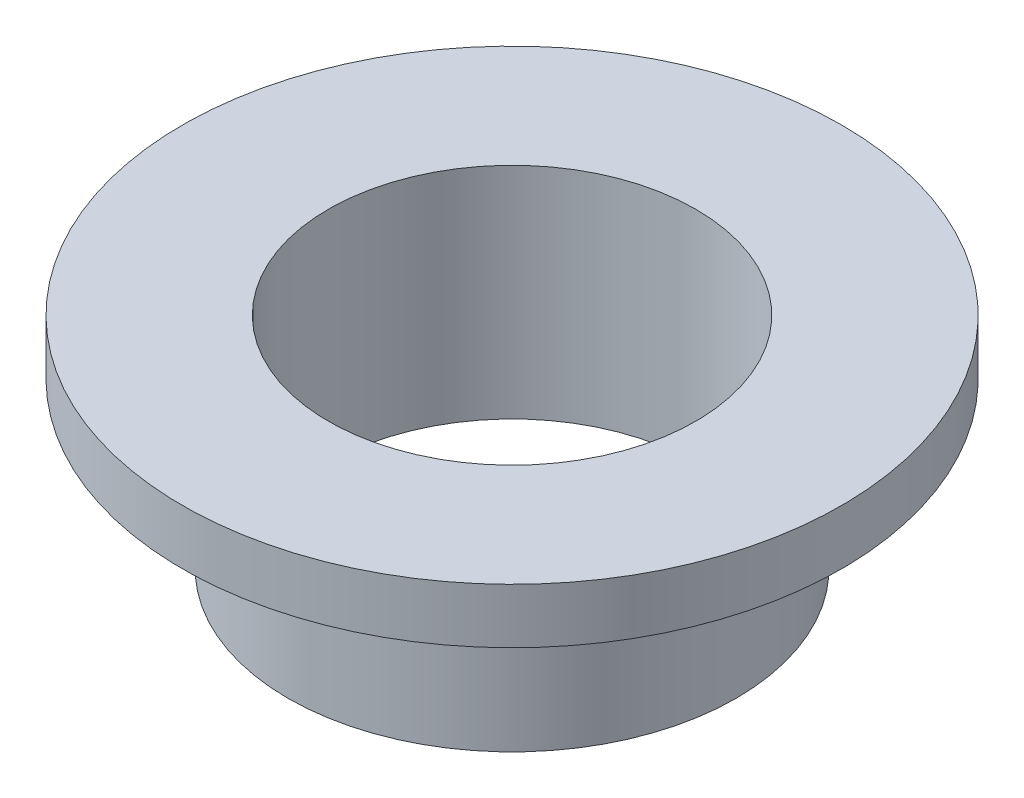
ISO-10303-21;
HEADER;
FILE_DESCRIPTION(('STEP AP214'),'2;1');
FILE_NAME('part.step','',(''),(''),'','','');
FILE_SCHEMA(('AUTOMOTIVE_DESIGN { 1 0 10303 214 1 1 1 1 }'));
ENDSEC;
DATA;
#1=APPLICATION_CONTEXT('core data for automotive mechanical design processes');
#2=APPLICATION_PROTOCOL_DEFINITION('international standard','automotive_design',2000,#1);
#3=PRODUCT_CONTEXT('',#1,'mechanical');
#4=PRODUCT('Part','Part','',(#3));
#5=PRODUCT_RELATED_PRODUCT_CATEGORY('part','',(#4));
#6=PRODUCT_DEFINITION_FORMATION('','',#4);
#7=PRODUCT_DEFINITION_CONTEXT('part definition',#1,'design');
#8=PRODUCT_DEFINITION('design','',#6,#7);
#9=PRODUCT_DEFINITION_SHAPE('','',#8);
#10=(LENGTH_UNIT() NAMED_UNIT(*) SI_UNIT(.MILLI.,.METRE.));
#11=(NAMED_UNIT(*) PLANE_ANGLE_UNIT() SI_UNIT($,.RADIAN.));
#12=(NAMED_UNIT(*) SI_UNIT($,.STERADIAN.) SOLID_ANGLE_UNIT());
#13=UNCERTAINTY_MEASURE_WITH_UNIT(LENGTH_MEASURE(1.E-05),#10,'distance_accuracy_value','');
#14=(GEOMETRIC_REPRESENTATION_CONTEXT(3) GLOBAL_UNCERTAINTY_ASSIGNED_CONTEXT((#13)) GLOBAL_UNIT_ASSIGNED_CONTEXT((#10,
#11,#12)) REPRESENTATION_CONTEXT('',''));
#15=CARTESIAN_POINT('',(0.,0.,0.));
#16=DIRECTION('',(0.,0.,1.));
#17=DIRECTION('',(1.,0.,0.));
#18=AXIS2_PLACEMENT_3D('',#15,#16,#17);
#19=CARTESIAN_POINT('',(0.,0.,0.));
#20=DIRECTION('',(0.,-1.,0.));
#21=DIRECTION('',(0.,0.,-1.));
#22=AXIS2_PLACEMENT_3D('',#19,#20,#21);
#23=CYLINDRICAL_SURFACE('',#22,4.7625);
#24=CARTESIAN_POINT('',(0.,0.,0.));
#25=DIRECTION('',(0.,-1.,0.));
#26=DIRECTION('',(0.,0.,-1.));
#27=AXIS2_PLACEMENT_3D('',#24,#25,#26);
#28=CIRCLE('',#27,4.7625);
#29=CARTESIAN_POINT('',(0.,0.,-4.7625));
#30=VERTEX_POINT('',#29);
#31=EDGE_CURVE('E10',#30,#30,#28,.T.);
#32=ORIENTED_EDGE('',*,*,#31,.F.);
#33=EDGE_LOOP('',(#32));
#34=FACE_BOUND('',#33,.T.);
#35=CARTESIAN_POINT('',(0.,0.79375,0.));
#36=DIRECTION('',(0.,-1.,0.));
#37=DIRECTION('',(0.,0.,-1.));
#38=AXIS2_PLACEMENT_3D('',#35,#36,#37);
#39=CIRCLE('',#38,4.7625);
#40=CARTESIAN_POINT('',(0.,0.79375,-4.7625));
#41=VERTEX_POINT('',#40);
#42=EDGE_CURVE('E54',#41,#41,#39,.T.);
#43=ORIENTED_EDGE('',*,*,#42,.T.);
#44=EDGE_LOOP('',(#43));
#45=FACE_BOUND('',#44,.T.);
#46=ADVANCED_FACE('F32',(#34,#45),#23,.T.);
#47=CARTESIAN_POINT('',(-4.7625,0.,0.));
#48=DIRECTION('',(0.,1.,0.));
#49=DIRECTION('',(0.,0.,1.));
#50=AXIS2_PLACEMENT_3D('',#47,#48,#49);
#51=PLANE('',#50);
#52=CARTESIAN_POINT('',(0.,0.,0.));
#53=DIRECTION('',(0.,-1.,0.));
#54=DIRECTION('',(0.,0.,-1.));
#55=AXIS2_PLACEMENT_3D('',#52,#53,#54);
#56=CIRCLE('',#55,3.2385);
#57=CARTESIAN_POINT('',(0.,0.,-3.2385));
#58=VERTEX_POINT('',#57);
#59=EDGE_CURVE('E38',#58,#58,#56,.T.);
#60=ORIENTED_EDGE('',*,*,#59,.F.);
#61=EDGE_LOOP('',(#60));
#62=FACE_BOUND('',#61,.T.);
#63=ORIENTED_EDGE('',*,*,#31,.T.);
#64=EDGE_LOOP('',(#63));
#65=FACE_BOUND('',#64,.T.);
#66=ADVANCED_FACE('F79',(#62,#65),#51,.F.);
#67=CARTESIAN_POINT('',(0.,0.,0.));
#68=DIRECTION('',(0.,-1.,0.));
#69=DIRECTION('',(0.,0.,-1.));
#70=AXIS2_PLACEMENT_3D('',#67,#68,#69);
#71=CYLINDRICAL_SURFACE('',#70,3.2385);
#72=CARTESIAN_POINT('',(0.,-2.38125,0.));
#73=DIRECTION('',(0.,-1.,0.));
#74=DIRECTION('',(0.,0.,-1.));
#75=AXIS2_PLACEMENT_3D('',#72,#73,#74);
#76=CIRCLE('',#75,3.2385);
#77=CARTESIAN_POINT('',(0.,-2.38125,-3.2385));
#78=VERTEX_POINT('',#77);
#79=EDGE_CURVE('E42',#78,#78,#76,.T.);
#80=ORIENTED_EDGE('',*,*,#79,.F.);
#81=EDGE_LOOP('',(#80));
#82=FACE_BOUND('',#81,.T.);
#83=ORIENTED_EDGE('',*,*,#59,.T.);
#84=EDGE_LOOP('',(#83));
#85=FACE_BOUND('',#84,.T.);
#86=ADVANCED_FACE('F74',(#82,#85),#71,.T.);
#87=CARTESIAN_POINT('',(-3.2385,-2.38125,0.));
#88=DIRECTION('',(0.,1.,0.));
#89=DIRECTION('',(0.,0.,1.));
#90=AXIS2_PLACEMENT_3D('',#87,#88,#89);
#91=PLANE('',#90);
#92=CARTESIAN_POINT('',(0.,-2.38125,0.));
#93=DIRECTION('',(0.,-1.,0.));
#94=DIRECTION('',(0.,0.,-1.));
#95=AXIS2_PLACEMENT_3D('',#92,#93,#94);
#96=CIRCLE('',#95,2.6543);
#97=CARTESIAN_POINT('',(0.,-2.38125,-2.6543));
#98=VERTEX_POINT('',#97);
#99=EDGE_CURVE('E46',#98,#98,#96,.T.);
#100=ORIENTED_EDGE('',*,*,#99,.F.);
#101=EDGE_LOOP('',(#100));
#102=FACE_BOUND('',#101,.T.);
#103=ORIENTED_EDGE('',*,*,#79,.T.);
#104=EDGE_LOOP('',(#103));
#105=FACE_BOUND('',#104,.T.);
#106=ADVANCED_FACE('F68',(#102,#105),#91,.F.);
#107=CARTESIAN_POINT('',(0.,0.,0.));
#108=DIRECTION('',(0.,-1.,0.));
#109=DIRECTION('',(0.,0.,-1.));
#110=AXIS2_PLACEMENT_3D('',#107,#108,#109);
#111=CYLINDRICAL_SURFACE('',#110,2.6543);
#112=CARTESIAN_POINT('',(0.,0.79375,0.));
#113=DIRECTION('',(0.,-1.,0.));
#114=DIRECTION('',(0.,0.,-1.));
#115=AXIS2_PLACEMENT_3D('',#112,#113,#114);
#116=CIRCLE('',#115,2.6543);
#117=CARTESIAN_POINT('',(0.,0.79375,-2.6543));
#118=VERTEX_POINT('',#117);
#119=EDGE_CURVE('E51',#118,#118,#116,.T.);
#120=ORIENTED_EDGE('',*,*,#119,.F.);
#121=EDGE_LOOP('',(#120));
#122=FACE_BOUND('',#121,.T.);
#123=ORIENTED_EDGE('',*,*,#99,.T.);
#124=EDGE_LOOP('',(#123));
#125=FACE_BOUND('',#124,.T.);
#126=ADVANCED_FACE('F62',(#122,#125),#111,.F.);
#127=CARTESIAN_POINT('',(-2.6543,0.79375,0.));
#128=DIRECTION('',(0.,-1.,0.));
#129=DIRECTION('',(0.,0.,-1.));
#130=AXIS2_PLACEMENT_3D('',#127,#128,#129);
#131=PLANE('',#130);
#132=ORIENTED_EDGE('',*,*,#42,.F.);
#133=EDGE_LOOP('',(#132));
#134=FACE_BOUND('',#133,.T.);
#135=ORIENTED_EDGE('',*,*,#119,.T.);
#136=EDGE_LOOP('',(#135));
#137=FACE_BOUND('',#136,.T.);
#138=ADVANCED_FACE('F59',(#134,#137),#131,.F.);
#139=CLOSED_SHELL('',(#46,#66,#86,#106,#126,#138));
#140=MANIFOLD_SOLID_BREP('B2',#139);
#141=ADVANCED_BREP_SHAPE_REPRESENTATION('',(#18,#140),#14);
#142=SHAPE_DEFINITION_REPRESENTATION(#9,#141);
ENDSEC;
END-ISO-10303-21;
